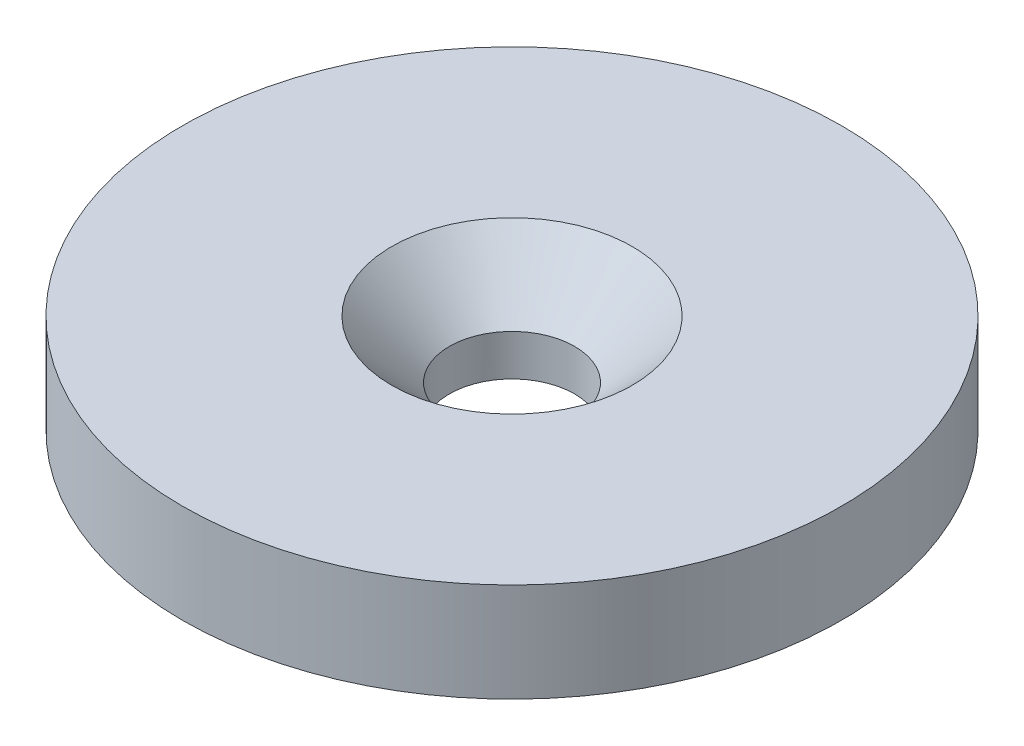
ISO-10303-21;
HEADER;
FILE_DESCRIPTION(('STEP AP214'),'2;1');
FILE_NAME('part.step','',(''),(''),'','','');
FILE_SCHEMA(('AUTOMOTIVE_DESIGN { 1 0 10303 214 1 1 1 1 }'));
ENDSEC;
DATA;
#1=APPLICATION_CONTEXT('core data for automotive mechanical design processes');
#2=APPLICATION_PROTOCOL_DEFINITION('international standard','automotive_design',2000,#1);
#3=PRODUCT_CONTEXT('',#1,'mechanical');
#4=PRODUCT('Part','Part','',(#3));
#5=PRODUCT_RELATED_PRODUCT_CATEGORY('part','',(#4));
#6=PRODUCT_DEFINITION_FORMATION('','',#4);
#7=PRODUCT_DEFINITION_CONTEXT('part definition',#1,'design');
#8=PRODUCT_DEFINITION('design','',#6,#7);
#9=PRODUCT_DEFINITION_SHAPE('','',#8);
#10=(LENGTH_UNIT() NAMED_UNIT(*) SI_UNIT(.MILLI.,.METRE.));
#11=(NAMED_UNIT(*) PLANE_ANGLE_UNIT() SI_UNIT($,.RADIAN.));
#12=(NAMED_UNIT(*) SI_UNIT($,.STERADIAN.) SOLID_ANGLE_UNIT());
#13=UNCERTAINTY_MEASURE_WITH_UNIT(LENGTH_MEASURE(1.E-05),#10,'distance_accuracy_value','');
#14=(GEOMETRIC_REPRESENTATION_CONTEXT(3) GLOBAL_UNCERTAINTY_ASSIGNED_CONTEXT((#13)) GLOBAL_UNIT_ASSIGNED_CONTEXT((#10,
#11,#12)) REPRESENTATION_CONTEXT('',''));
#15=CARTESIAN_POINT('',(0.,0.,0.));
#16=DIRECTION('',(0.,0.,1.));
#17=DIRECTION('',(1.,0.,0.));
#18=AXIS2_PLACEMENT_3D('',#15,#16,#17);
#19=CARTESIAN_POINT('',(-8.,-24.,42.325));
#20=DIRECTION('',(0.,1.,0.));
#21=DIRECTION('',(0.,0.,1.));
#22=AXIS2_PLACEMENT_3D('',#19,#20,#21);
#23=PLANE('',#22);
#24=CARTESIAN_POINT('',(-8.,-23.9999999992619,35.5));
#25=DIRECTION('',(0.,1.,0.));
#26=DIRECTION('',(0.,0.,1.));
#27=AXIS2_PLACEMENT_3D('',#24,#25,#26);
#28=CIRCLE('',#27,3.64999999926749);
#29=CARTESIAN_POINT('',(-8.,-23.9999999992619,39.1499999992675));
#30=VERTEX_POINT('',#29);
#31=EDGE_CURVE('E17',#30,#30,#28,.F.);
#32=ORIENTED_EDGE('',*,*,#31,.T.);
#33=EDGE_LOOP('',(#32));
#34=FACE_BOUND('',#33,.T.);
#35=CARTESIAN_POINT('',(-8.,-24.,35.5));
#36=DIRECTION('',(0.,-1.,0.));
#37=DIRECTION('',(0.,0.,-1.));
#38=AXIS2_PLACEMENT_3D('',#35,#36,#37);
#39=CIRCLE('',#38,10.);
#40=CARTESIAN_POINT('',(-8.,-24.,25.5));
#41=VERTEX_POINT('',#40);
#42=EDGE_CURVE('E31',#41,#41,#39,.T.);
#43=ORIENTED_EDGE('',*,*,#42,.F.);
#44=EDGE_LOOP('',(#43));
#45=FACE_BOUND('',#44,.T.);
#46=ADVANCED_FACE('F14',(#34,#45),#23,.T.);
#47=CARTESIAN_POINT('',(-8.,-23.9999999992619,35.5));
#48=DIRECTION('',(0.,1.,0.));
#49=DIRECTION('',(0.,0.,1.));
#50=AXIS2_PLACEMENT_3D('',#47,#48,#49);
#51=CONICAL_SURFACE('',#50,3.64999999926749,0.785398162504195);
#52=CARTESIAN_POINT('',(-8.,-25.75,35.5));
#53=DIRECTION('',(0.,-1.,0.));
#54=DIRECTION('',(0.,0.,-1.));
#55=AXIS2_PLACEMENT_3D('',#52,#53,#54);
#56=CIRCLE('',#55,1.9);
#57=CARTESIAN_POINT('',(-8.,-25.75,33.6));
#58=VERTEX_POINT('',#57);
#59=EDGE_CURVE('E26',#58,#58,#56,.T.);
#60=ORIENTED_EDGE('',*,*,#59,.T.);
#61=EDGE_LOOP('',(#60));
#62=FACE_BOUND('',#61,.T.);
#63=ORIENTED_EDGE('',*,*,#31,.F.);
#64=EDGE_LOOP('',(#63));
#65=FACE_BOUND('',#64,.T.);
#66=ADVANCED_FACE('F41',(#62,#65),#51,.F.);
#67=CARTESIAN_POINT('',(-8.,-25.5,35.5));
#68=DIRECTION('',(0.,-1.,0.));
#69=DIRECTION('',(0.,0.,-1.));
#70=AXIS2_PLACEMENT_3D('',#67,#68,#69);
#71=CYLINDRICAL_SURFACE('',#70,10.);
#72=ORIENTED_EDGE('',*,*,#42,.T.);
#73=EDGE_LOOP('',(#72));
#74=FACE_BOUND('',#73,.T.);
#75=CARTESIAN_POINT('',(-8.,-27.,35.5));
#76=DIRECTION('',(0.,-1.,0.));
#77=DIRECTION('',(0.,0.,-1.));
#78=AXIS2_PLACEMENT_3D('',#75,#76,#77);
#79=CIRCLE('',#78,10.);
#80=CARTESIAN_POINT('',(-8.,-27.,25.5));
#81=VERTEX_POINT('',#80);
#82=EDGE_CURVE('E21',#81,#81,#79,.T.);
#83=ORIENTED_EDGE('',*,*,#82,.F.);
#84=EDGE_LOOP('',(#83));
#85=FACE_BOUND('',#84,.T.);
#86=ADVANCED_FACE('F43',(#74,#85),#71,.T.);
#87=CARTESIAN_POINT('',(-8.,-26.375,35.5));
#88=DIRECTION('',(0.,-1.,0.));
#89=DIRECTION('',(0.,0.,-1.));
#90=AXIS2_PLACEMENT_3D('',#87,#88,#89);
#91=CYLINDRICAL_SURFACE('',#90,1.9);
#92=CARTESIAN_POINT('',(-8.,-27.,35.5));
#93=DIRECTION('',(0.,-1.,0.));
#94=DIRECTION('',(0.,0.,-1.));
#95=AXIS2_PLACEMENT_3D('',#92,#93,#94);
#96=CIRCLE('',#95,1.9);
#97=CARTESIAN_POINT('',(-8.,-27.,33.6));
#98=VERTEX_POINT('',#97);
#99=EDGE_CURVE('E10',#98,#98,#96,.F.);
#100=ORIENTED_EDGE('',*,*,#99,.F.);
#101=EDGE_LOOP('',(#100));
#102=FACE_BOUND('',#101,.T.);
#103=ORIENTED_EDGE('',*,*,#59,.F.);
#104=EDGE_LOOP('',(#103));
#105=FACE_BOUND('',#104,.T.);
#106=ADVANCED_FACE('F51',(#102,#105),#91,.F.);
#107=CARTESIAN_POINT('',(-8.,-27.,41.45));
#108=DIRECTION('',(0.,-1.,0.));
#109=DIRECTION('',(0.,0.,-1.));
#110=AXIS2_PLACEMENT_3D('',#107,#108,#109);
#111=PLANE('',#110);
#112=ORIENTED_EDGE('',*,*,#99,.T.);
#113=EDGE_LOOP('',(#112));
#114=FACE_BOUND('',#113,.T.);
#115=ORIENTED_EDGE('',*,*,#82,.T.);
#116=EDGE_LOOP('',(#115));
#117=FACE_BOUND('',#116,.T.);
#118=ADVANCED_FACE('F53',(#114,#117),#111,.T.);
#119=CLOSED_SHELL('',(#46,#66,#86,#106,#118));
#120=MANIFOLD_SOLID_BREP('B1',#119);
#121=ADVANCED_BREP_SHAPE_REPRESENTATION('',(#18,#120),#14);
#122=SHAPE_DEFINITION_REPRESENTATION(#9,#121);
ENDSEC;
END-ISO-10303-21;
